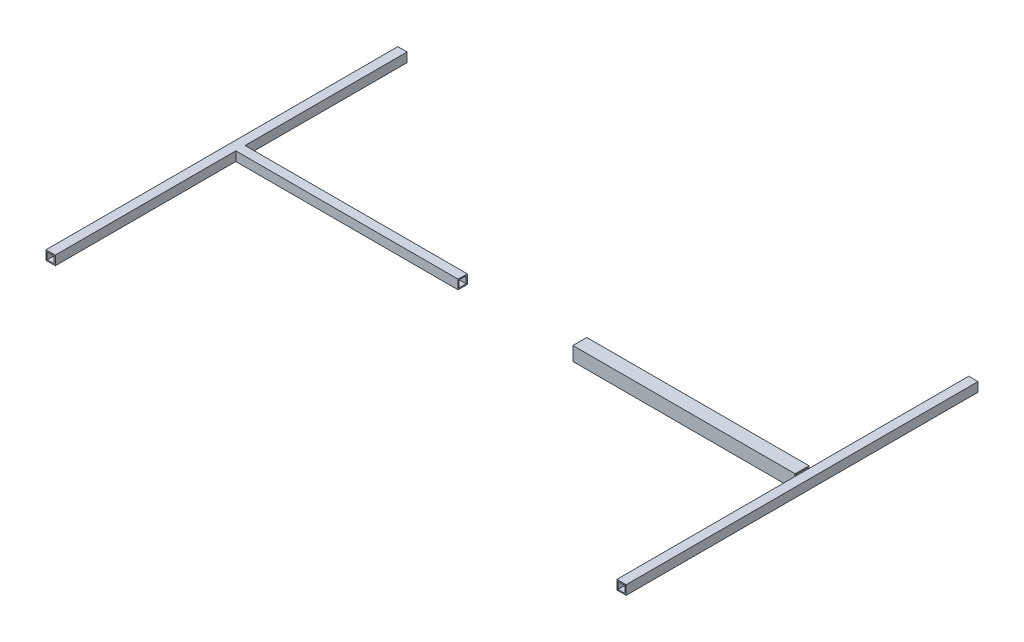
from build123d import *

# Parameters (mm, degrees)
SKETCH2_W             = 12.7
SKETCH2_H             = 12.7
SKETCH2_W_2           = 9.525
SKETCH2_H_2           = 9.525
BOSS_EXTRUDE1_DEPTH   = 482.6
BOSS_EXTRUDE1_2_DEPTH = 482.6
SKETCH5_W             = 12.7
SKETCH5_H             = 12.7
SKETCH5_W_2           = 9.525
SKETCH5_H_2           = 9.525
BOSS_EXTRUDE2_DEPTH   = 304.8
SKETCH6_W             = 19.05
SKETCH6_H             = 19.05
SKETCH6_W_2           = 15.875
SKETCH6_H_2           = 15.875
BOSS_EXTRUDE3_DEPTH   = 304.8


with BuildPart() as part:
    # Sketch2 → Boss-Extrude1 (new body)
    with BuildSketch(Plane.XY):
        with Locations((-783.043443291, 0)):
            Rectangle(SKETCH2_W, SKETCH2_H)
        with Locations((-783.043443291, 0)):
            Rectangle(SKETCH2_W_2, SKETCH2_H_2, mode=Mode.SUBTRACT)
    extrude(amount=-BOSS_EXTRUDE1_DEPTH)

    # Sketch5 → Boss-Extrude2 (add)
    with BuildSketch(Plane(origin=(-471.893443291, 0, 0), x_dir=(0, 0, -1), z_dir=(1, 0, 0))):
        with Locations((254, 0)):
            Rectangle(SKETCH5_W, SKETCH5_H)
        with Locations((254, 0)):
            Rectangle(SKETCH5_W_2, SKETCH5_H_2, mode=Mode.SUBTRACT)
    extrude(amount=-BOSS_EXTRUDE2_DEPTH)


with BuildPart() as body_2:
    # Sketch2 → Boss-Extrude1 2 (new body)
    with BuildSketch(Plane.XY):
        Rectangle(SKETCH2_W, SKETCH2_H)
        Rectangle(SKETCH2_W_2, SKETCH2_H_2, mode=Mode.SUBTRACT)
    extrude(amount=-BOSS_EXTRUDE1_2_DEPTH)

    # Sketch6 → Boss-Extrude3 (add)
    with BuildSketch(Plane.ZY.offset(311.15)):
        with Locations((-254, 0)):
            Rectangle(SKETCH6_W, SKETCH6_H)
        with Locations((-254, 0)):
            Rectangle(SKETCH6_W_2, SKETCH6_H_2, mode=Mode.SUBTRACT)
    extrude(amount=-BOSS_EXTRUDE3_DEPTH)


solid = Compound([part.part, body_2.part])
